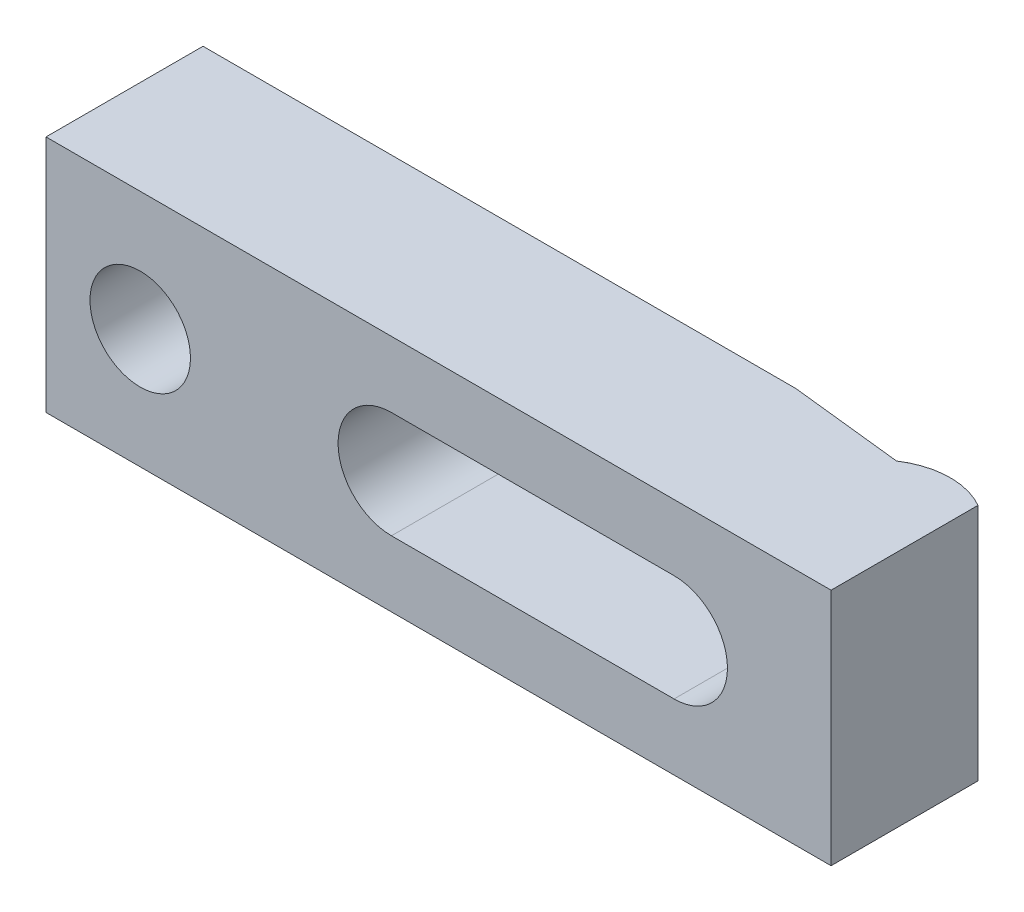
ISO-10303-21;
HEADER;
FILE_DESCRIPTION(('STEP AP214'),'2;1');
FILE_NAME('part.step','',(''),(''),'','','');
FILE_SCHEMA(('AUTOMOTIVE_DESIGN { 1 0 10303 214 1 1 1 1 }'));
ENDSEC;
DATA;
#1=APPLICATION_CONTEXT('core data for automotive mechanical design processes');
#2=APPLICATION_PROTOCOL_DEFINITION('international standard','automotive_design',2000,#1);
#3=PRODUCT_CONTEXT('',#1,'mechanical');
#4=PRODUCT('Part','Part','',(#3));
#5=PRODUCT_RELATED_PRODUCT_CATEGORY('part','',(#4));
#6=PRODUCT_DEFINITION_FORMATION('','',#4);
#7=PRODUCT_DEFINITION_CONTEXT('part definition',#1,'design');
#8=PRODUCT_DEFINITION('design','',#6,#7);
#9=PRODUCT_DEFINITION_SHAPE('','',#8);
#10=(LENGTH_UNIT() NAMED_UNIT(*) SI_UNIT(.MILLI.,.METRE.));
#11=(NAMED_UNIT(*) PLANE_ANGLE_UNIT() SI_UNIT($,.RADIAN.));
#12=(NAMED_UNIT(*) SI_UNIT($,.STERADIAN.) SOLID_ANGLE_UNIT());
#13=UNCERTAINTY_MEASURE_WITH_UNIT(LENGTH_MEASURE(1.E-05),#10,'distance_accuracy_value','');
#14=(GEOMETRIC_REPRESENTATION_CONTEXT(3) GLOBAL_UNCERTAINTY_ASSIGNED_CONTEXT((#13)) GLOBAL_UNIT_ASSIGNED_CONTEXT((#10,
#11,#12)) REPRESENTATION_CONTEXT('',''));
#15=CARTESIAN_POINT('',(0.,0.,0.));
#16=DIRECTION('',(0.,0.,1.));
#17=DIRECTION('',(1.,0.,0.));
#18=AXIS2_PLACEMENT_3D('',#15,#16,#17);
#19=CARTESIAN_POINT('',(-100.,19.,0.));
#20=DIRECTION('',(0.,0.,-1.));
#21=DIRECTION('',(-1.,0.,0.));
#22=AXIS2_PLACEMENT_3D('',#19,#20,#21);
#23=PLANE('',#22);
#24=DIRECTION('',(1.,0.,0.));
#25=VECTOR('',#24,1.);
#26=CARTESIAN_POINT('',(-40.,8.5,0.));
#27=LINE('',#26,#25);
#28=CARTESIAN_POINT('',(-100.,8.5,0.));
#29=VERTEX_POINT('',#28);
#30=CARTESIAN_POINT('',(-5.6,8.5,0.));
#31=VERTEX_POINT('',#30);
#32=EDGE_CURVE('E151',#29,#31,#27,.T.);
#33=ORIENTED_EDGE('',*,*,#32,.F.);
#34=DIRECTION('',(0.,-1.,0.));
#35=VECTOR('',#34,1.);
#36=CARTESIAN_POINT('',(-100.,19.,0.));
#37=LINE('',#36,#35);
#38=CARTESIAN_POINT('',(-100.,19.,0.));
#39=VERTEX_POINT('',#38);
#40=EDGE_CURVE('E203',#39,#29,#37,.T.);
#41=ORIENTED_EDGE('',*,*,#40,.F.);
#42=DIRECTION('',(1.,0.,0.));
#43=VECTOR('',#42,1.);
#44=CARTESIAN_POINT('',(-100.,19.,0.));
#45=LINE('',#44,#43);
#46=CARTESIAN_POINT('',(-5.6,19.,0.));
#47=VERTEX_POINT('',#46);
#48=EDGE_CURVE('E194',#39,#47,#45,.T.);
#49=ORIENTED_EDGE('',*,*,#48,.T.);
#50=DIRECTION('',(0.,-1.,0.));
#51=VECTOR('',#50,1.);
#52=CARTESIAN_POINT('',(-5.6,19.,0.));
#53=LINE('',#52,#51);
#54=EDGE_CURVE('E207',#47,#31,#53,.T.);
#55=ORIENTED_EDGE('',*,*,#54,.T.);
#56=EDGE_LOOP('',(#33,#41,#49,#55));
#57=FACE_BOUND('',#56,.T.);
#58=ADVANCED_FACE('F14',(#57),#23,.T.);
#59=CARTESIAN_POINT('',(-100.,19.,25.));
#60=DIRECTION('',(-1.,0.,0.));
#61=DIRECTION('',(0.,0.,1.));
#62=AXIS2_PLACEMENT_3D('',#59,#60,#61);
#63=PLANE('',#62);
#64=ORIENTED_EDGE('',*,*,#40,.T.);
#65=DIRECTION('',(0.,0.,1.));
#66=VECTOR('',#65,1.);
#67=CARTESIAN_POINT('',(-100.,8.5,25.));
#68=LINE('',#67,#66);
#69=CARTESIAN_POINT('',(-100.,8.5,5.));
#70=VERTEX_POINT('',#69);
#71=EDGE_CURVE('E145',#29,#70,#68,.T.);
#72=ORIENTED_EDGE('',*,*,#71,.T.);
#73=DIRECTION('',(0.,-1.,0.));
#74=VECTOR('',#73,1.);
#75=CARTESIAN_POINT('',(-100.,19.,5.));
#76=LINE('',#75,#74);
#77=CARTESIAN_POINT('',(-100.,-8.5,5.));
#78=VERTEX_POINT('',#77);
#79=EDGE_CURVE('E140',#70,#78,#76,.T.);
#80=ORIENTED_EDGE('',*,*,#79,.T.);
#81=DIRECTION('',(0.,0.,1.));
#82=VECTOR('',#81,1.);
#83=CARTESIAN_POINT('',(-100.,-8.5,25.));
#84=LINE('',#83,#82);
#85=CARTESIAN_POINT('',(-100.,-8.5,0.));
#86=VERTEX_POINT('',#85);
#87=EDGE_CURVE('E143',#86,#78,#84,.T.);
#88=ORIENTED_EDGE('',*,*,#87,.F.);
#89=CARTESIAN_POINT('',(-100.,-19.,0.));
#90=VERTEX_POINT('',#89);
#91=EDGE_CURVE('E202',#86,#90,#37,.T.);
#92=ORIENTED_EDGE('',*,*,#91,.T.);
#93=DIRECTION('',(0.,0.,-1.));
#94=VECTOR('',#93,1.);
#95=CARTESIAN_POINT('',(-100.,-19.,25.));
#96=LINE('',#95,#94);
#97=CARTESIAN_POINT('',(-100.,-19.,25.));
#98=VERTEX_POINT('',#97);
#99=EDGE_CURVE('E179',#98,#90,#96,.T.);
#100=ORIENTED_EDGE('',*,*,#99,.F.);
#101=DIRECTION('',(0.,-1.,0.));
#102=VECTOR('',#101,1.);
#103=CARTESIAN_POINT('',(-100.,19.,25.));
#104=LINE('',#103,#102);
#105=CARTESIAN_POINT('',(-100.,19.,25.));
#106=VERTEX_POINT('',#105);
#107=EDGE_CURVE('E187',#106,#98,#104,.T.);
#108=ORIENTED_EDGE('',*,*,#107,.F.);
#109=DIRECTION('',(0.,0.,-1.));
#110=VECTOR('',#109,1.);
#111=CARTESIAN_POINT('',(-100.,19.,25.));
#112=LINE('',#111,#110);
#113=EDGE_CURVE('E197',#106,#39,#112,.T.);
#114=ORIENTED_EDGE('',*,*,#113,.T.);
#115=EDGE_LOOP('',(#64,#72,#80,#88,#92,#100,#108,#114));
#116=FACE_BOUND('',#115,.T.);
#117=ADVANCED_FACE('F235',(#116),#63,.T.);
#118=CARTESIAN_POINT('',(-85.,0.,25.));
#119=DIRECTION('',(0.,0.,-1.));
#120=DIRECTION('',(-1.,0.,0.));
#121=AXIS2_PLACEMENT_3D('',#118,#119,#120);
#122=CYLINDRICAL_SURFACE('',#121,8.);
#123=CARTESIAN_POINT('',(-85.,0.,25.));
#124=DIRECTION('',(0.,0.,1.));
#125=DIRECTION('',(1.,0.,0.));
#126=AXIS2_PLACEMENT_3D('',#123,#124,#125);
#127=CIRCLE('',#126,8.);
#128=CARTESIAN_POINT('',(-77.,0.,25.));
#129=VERTEX_POINT('',#128);
#130=EDGE_CURVE('E148',#129,#129,#127,.T.);
#131=ORIENTED_EDGE('',*,*,#130,.T.);
#132=EDGE_LOOP('',(#131));
#133=FACE_BOUND('',#132,.T.);
#134=CARTESIAN_POINT('',(-85.,0.,5.));
#135=DIRECTION('',(0.,0.,-1.));
#136=DIRECTION('',(-1.,0.,0.));
#137=AXIS2_PLACEMENT_3D('',#134,#135,#136);
#138=CIRCLE('',#137,8.);
#139=CARTESIAN_POINT('',(-93.,0.,5.));
#140=VERTEX_POINT('',#139);
#141=EDGE_CURVE('E138',#140,#140,#138,.T.);
#142=ORIENTED_EDGE('',*,*,#141,.T.);
#143=EDGE_LOOP('',(#142));
#144=FACE_BOUND('',#143,.T.);
#145=ADVANCED_FACE('F218',(#133,#144),#122,.F.);
#146=CARTESIAN_POINT('',(25.,19.,25.));
#147=DIRECTION('',(0.,0.,1.));
#148=DIRECTION('',(1.,0.,0.));
#149=AXIS2_PLACEMENT_3D('',#146,#147,#148);
#150=PLANE('',#149);
#151=CARTESIAN_POINT('',(-45.,0.,25.));
#152=DIRECTION('',(0.,0.,1.));
#153=DIRECTION('',(-1.,0.,0.));
#154=AXIS2_PLACEMENT_3D('',#151,#152,#153);
#155=CIRCLE('',#154,8.5);
#156=CARTESIAN_POINT('',(-45.,8.5,25.));
#157=VERTEX_POINT('',#156);
#158=CARTESIAN_POINT('',(-45.,-8.5,25.));
#159=VERTEX_POINT('',#158);
#160=EDGE_CURVE('E115',#157,#159,#155,.T.);
#161=ORIENTED_EDGE('',*,*,#160,.F.);
#162=DIRECTION('',(1.,0.,0.));
#163=VECTOR('',#162,1.);
#164=CARTESIAN_POINT('',(-40.,8.5,25.));
#165=LINE('',#164,#163);
#166=CARTESIAN_POINT('',(0.,8.5,25.));
#167=VERTEX_POINT('',#166);
#168=EDGE_CURVE('E119',#157,#167,#165,.T.);
#169=ORIENTED_EDGE('',*,*,#168,.T.);
#170=CARTESIAN_POINT('',(0.,0.,25.));
#171=DIRECTION('',(0.,0.,1.));
#172=DIRECTION('',(1.,0.,0.));
#173=AXIS2_PLACEMENT_3D('',#170,#171,#172);
#174=CIRCLE('',#173,8.5);
#175=CARTESIAN_POINT('',(0.,-8.5,25.));
#176=VERTEX_POINT('',#175);
#177=EDGE_CURVE('E117',#176,#167,#174,.T.);
#178=ORIENTED_EDGE('',*,*,#177,.F.);
#179=DIRECTION('',(-1.,0.,0.));
#180=VECTOR('',#179,1.);
#181=CARTESIAN_POINT('',(0.,-8.5,25.));
#182=LINE('',#181,#180);
#183=EDGE_CURVE('E111',#176,#159,#182,.T.);
#184=ORIENTED_EDGE('',*,*,#183,.T.);
#185=EDGE_LOOP('',(#161,#169,#178,#184));
#186=FACE_BOUND('',#185,.T.);
#187=DIRECTION('',(0.,-1.,0.));
#188=VECTOR('',#187,1.);
#189=CARTESIAN_POINT('',(25.,19.,25.));
#190=LINE('',#189,#188);
#191=CARTESIAN_POINT('',(25.,19.,25.));
#192=VERTEX_POINT('',#191);
#193=CARTESIAN_POINT('',(25.,-19.,25.));
#194=VERTEX_POINT('',#193);
#195=EDGE_CURVE('E37',#192,#194,#190,.T.);
#196=ORIENTED_EDGE('',*,*,#195,.F.);
#197=DIRECTION('',(-1.,0.,0.));
#198=VECTOR('',#197,1.);
#199=CARTESIAN_POINT('',(25.,19.,25.));
#200=LINE('',#199,#198);
#201=EDGE_CURVE('E169',#192,#106,#200,.T.);
#202=ORIENTED_EDGE('',*,*,#201,.T.);
#203=ORIENTED_EDGE('',*,*,#107,.T.);
#204=DIRECTION('',(-1.,0.,0.));
#205=VECTOR('',#204,1.);
#206=CARTESIAN_POINT('',(25.,-19.,25.));
#207=LINE('',#206,#205);
#208=EDGE_CURVE('E165',#194,#98,#207,.T.);
#209=ORIENTED_EDGE('',*,*,#208,.F.);
#210=EDGE_LOOP('',(#196,#202,#203,#209));
#211=FACE_BOUND('',#210,.T.);
#212=ORIENTED_EDGE('',*,*,#130,.F.);
#213=EDGE_LOOP('',(#212));
#214=FACE_BOUND('',#213,.T.);
#215=ADVANCED_FACE('F113',(#186,#211,#214),#150,.T.);
#216=ORIENTED_EDGE('',*,*,#91,.F.);
#217=DIRECTION('',(-1.,0.,0.));
#218=VECTOR('',#217,1.);
#219=CARTESIAN_POINT('',(0.,-8.5,0.));
#220=LINE('',#219,#218);
#221=CARTESIAN_POINT('',(-5.6,-8.5,0.));
#222=VERTEX_POINT('',#221);
#223=EDGE_CURVE('E152',#222,#86,#220,.T.);
#224=ORIENTED_EDGE('',*,*,#223,.F.);
#225=CARTESIAN_POINT('',(-5.6,-19.,0.));
#226=VERTEX_POINT('',#225);
#227=EDGE_CURVE('E206',#222,#226,#53,.T.);
#228=ORIENTED_EDGE('',*,*,#227,.T.);
#229=DIRECTION('',(1.,0.,0.));
#230=VECTOR('',#229,1.);
#231=CARTESIAN_POINT('',(-100.,-19.,0.));
#232=LINE('',#231,#230);
#233=EDGE_CURVE('E176',#90,#226,#232,.T.);
#234=ORIENTED_EDGE('',*,*,#233,.F.);
#235=EDGE_LOOP('',(#216,#224,#228,#234));
#236=FACE_BOUND('',#235,.T.);
#237=ADVANCED_FACE('F238',(#236),#23,.T.);
#238=CARTESIAN_POINT('',(25.,19.,25.));
#239=DIRECTION('',(-1.,0.,0.));
#240=DIRECTION('',(0.,0.,1.));
#241=AXIS2_PLACEMENT_3D('',#238,#239,#240);
#242=PLANE('',#241);
#243=DIRECTION('',(0.,-1.,0.));
#244=VECTOR('',#243,1.);
#245=CARTESIAN_POINT('',(25.,19.,1.60769515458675));
#246=LINE('',#245,#244);
#247=CARTESIAN_POINT('',(25.,19.,1.60769515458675));
#248=VERTEX_POINT('',#247);
#249=CARTESIAN_POINT('',(25.,-19.,1.60769515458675));
#250=VERTEX_POINT('',#249);
#251=EDGE_CURVE('E212',#248,#250,#246,.T.);
#252=ORIENTED_EDGE('',*,*,#251,.F.);
#253=DIRECTION('',(0.,0.,-1.));
#254=VECTOR('',#253,1.);
#255=CARTESIAN_POINT('',(25.,19.,25.));
#256=LINE('',#255,#254);
#257=EDGE_CURVE('E184',#192,#248,#256,.T.);
#258=ORIENTED_EDGE('',*,*,#257,.F.);
#259=ORIENTED_EDGE('',*,*,#195,.T.);
#260=DIRECTION('',(0.,0.,-1.));
#261=VECTOR('',#260,1.);
#262=CARTESIAN_POINT('',(25.,-19.,25.));
#263=LINE('',#262,#261);
#264=EDGE_CURVE('E166',#194,#250,#263,.T.);
#265=ORIENTED_EDGE('',*,*,#264,.T.);
#266=EDGE_LOOP('',(#252,#258,#259,#265));
#267=FACE_BOUND('',#266,.T.);
#268=ADVANCED_FACE('F16',(#267),#242,.F.);
#269=CARTESIAN_POINT('',(19.,19.,12.));
#270=DIRECTION('',(0.,-1.,0.));
#271=DIRECTION('',(0.,0.,-1.));
#272=AXIS2_PLACEMENT_3D('',#269,#270,#271);
#273=CYLINDRICAL_SURFACE('',#272,12.);
#274=DIRECTION('',(0.,-1.,0.));
#275=VECTOR('',#274,1.);
#276=CARTESIAN_POINT('',(12.4,19.,1.97802414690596));
#277=LINE('',#276,#275);
#278=CARTESIAN_POINT('',(12.4,19.,1.97802414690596));
#279=VERTEX_POINT('',#278);
#280=CARTESIAN_POINT('',(12.4,-19.,1.97802414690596));
#281=VERTEX_POINT('',#280);
#282=EDGE_CURVE('E210',#279,#281,#277,.T.);
#283=ORIENTED_EDGE('',*,*,#282,.F.);
#284=CARTESIAN_POINT('',(19.,19.,12.));
#285=DIRECTION('',(0.,1.,0.));
#286=DIRECTION('',(0.,0.,1.));
#287=AXIS2_PLACEMENT_3D('',#284,#285,#286);
#288=CIRCLE('',#287,12.);
#289=EDGE_CURVE('E188',#248,#279,#288,.T.);
#290=ORIENTED_EDGE('',*,*,#289,.F.);
#291=ORIENTED_EDGE('',*,*,#251,.T.);
#292=CARTESIAN_POINT('',(19.,-19.,12.));
#293=DIRECTION('',(0.,1.,0.));
#294=DIRECTION('',(0.,0.,1.));
#295=AXIS2_PLACEMENT_3D('',#292,#293,#294);
#296=CIRCLE('',#295,12.);
#297=EDGE_CURVE('E170',#250,#281,#296,.T.);
#298=ORIENTED_EDGE('',*,*,#297,.T.);
#299=EDGE_LOOP('',(#283,#290,#291,#298));
#300=FACE_BOUND('',#299,.T.);
#301=ADVANCED_FACE('F253',(#300),#273,.T.);
#302=CARTESIAN_POINT('',(12.4,19.,1.97802414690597));
#303=DIRECTION('',(-0.109232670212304,0.,0.99401620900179));
#304=DIRECTION('',(0.99401620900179,0.,0.109232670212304));
#305=AXIS2_PLACEMENT_3D('',#302,#303,#304);
#306=PLANE('',#305);
#307=CARTESIAN_POINT('',(0.,0.,0.615385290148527));
#308=DIRECTION('',(-0.109232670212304,0.,0.99401620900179));
#309=DIRECTION('',(-0.99401620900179,0.,-0.109232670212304));
#310=AXIS2_PLACEMENT_3D('',#307,#308,#309);
#311=ELLIPSE('',#310,8.55116840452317,8.5);
#312=CARTESIAN_POINT('',(0.,8.5,0.615385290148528));
#313=VERTEX_POINT('',#312);
#314=CARTESIAN_POINT('',(0.,-8.5,0.615385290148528));
#315=VERTEX_POINT('',#314);
#316=EDGE_CURVE('E22',#313,#315,#311,.F.);
#317=ORIENTED_EDGE('',*,*,#316,.F.);
#318=DIRECTION('',(-0.99401620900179,0.,-0.109232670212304));
#319=VECTOR('',#318,1.);
#320=CARTESIAN_POINT('',(12.4,8.5,1.97802414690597));
#321=LINE('',#320,#319);
#322=EDGE_CURVE('E162',#313,#31,#321,.T.);
#323=ORIENTED_EDGE('',*,*,#322,.T.);
#324=ORIENTED_EDGE('',*,*,#54,.F.);
#325=DIRECTION('',(-0.99401620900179,0.,-0.109232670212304));
#326=VECTOR('',#325,1.);
#327=CARTESIAN_POINT('',(12.4,19.,1.97802414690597));
#328=LINE('',#327,#326);
#329=EDGE_CURVE('E191',#279,#47,#328,.T.);
#330=ORIENTED_EDGE('',*,*,#329,.F.);
#331=ORIENTED_EDGE('',*,*,#282,.T.);
#332=DIRECTION('',(-0.99401620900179,0.,-0.109232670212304));
#333=VECTOR('',#332,1.);
#334=CARTESIAN_POINT('',(12.4,-19.,1.97802414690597));
#335=LINE('',#334,#333);
#336=EDGE_CURVE('E173',#281,#226,#335,.T.);
#337=ORIENTED_EDGE('',*,*,#336,.T.);
#338=ORIENTED_EDGE('',*,*,#227,.F.);
#339=DIRECTION('',(0.99401620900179,0.,0.109232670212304));
#340=VECTOR('',#339,1.);
#341=CARTESIAN_POINT('',(12.4,-8.5,1.97802414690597));
#342=LINE('',#341,#340);
#343=EDGE_CURVE('E29',#222,#315,#342,.T.);
#344=ORIENTED_EDGE('',*,*,#343,.T.);
#345=EDGE_LOOP('',(#317,#323,#324,#330,#331,#337,#338,#344));
#346=FACE_BOUND('',#345,.T.);
#347=ADVANCED_FACE('F281',(#346),#306,.F.);
#348=CARTESIAN_POINT('',(19.,19.,12.));
#349=DIRECTION('',(0.,1.,0.));
#350=DIRECTION('',(0.,0.,1.));
#351=AXIS2_PLACEMENT_3D('',#348,#349,#350);
#352=PLANE('',#351);
#353=ORIENTED_EDGE('',*,*,#201,.F.);
#354=ORIENTED_EDGE('',*,*,#257,.T.);
#355=ORIENTED_EDGE('',*,*,#289,.T.);
#356=ORIENTED_EDGE('',*,*,#329,.T.);
#357=ORIENTED_EDGE('',*,*,#48,.F.);
#358=ORIENTED_EDGE('',*,*,#113,.F.);
#359=EDGE_LOOP('',(#353,#354,#355,#356,#357,#358));
#360=FACE_BOUND('',#359,.T.);
#361=ADVANCED_FACE('F270',(#360),#352,.T.);
#362=CARTESIAN_POINT('',(19.,-19.,12.));
#363=DIRECTION('',(0.,1.,0.));
#364=DIRECTION('',(0.,0.,1.));
#365=AXIS2_PLACEMENT_3D('',#362,#363,#364);
#366=PLANE('',#365);
#367=ORIENTED_EDGE('',*,*,#208,.T.);
#368=ORIENTED_EDGE('',*,*,#99,.T.);
#369=ORIENTED_EDGE('',*,*,#233,.T.);
#370=ORIENTED_EDGE('',*,*,#336,.F.);
#371=ORIENTED_EDGE('',*,*,#297,.F.);
#372=ORIENTED_EDGE('',*,*,#264,.F.);
#373=EDGE_LOOP('',(#367,#368,#369,#370,#371,#372));
#374=FACE_BOUND('',#373,.T.);
#375=ADVANCED_FACE('F262',(#374),#366,.F.);
#376=CARTESIAN_POINT('',(0.,0.,25.));
#377=DIRECTION('',(0.,0.,-1.));
#378=DIRECTION('',(-1.,0.,0.));
#379=AXIS2_PLACEMENT_3D('',#376,#377,#378);
#380=CYLINDRICAL_SURFACE('',#379,8.5);
#381=ORIENTED_EDGE('',*,*,#316,.T.);
#382=DIRECTION('',(0.,0.,-1.));
#383=VECTOR('',#382,1.);
#384=CARTESIAN_POINT('',(0.,-8.5,25.));
#385=LINE('',#384,#383);
#386=EDGE_CURVE('E118',#176,#315,#385,.T.);
#387=ORIENTED_EDGE('',*,*,#386,.F.);
#388=ORIENTED_EDGE('',*,*,#177,.T.);
#389=DIRECTION('',(0.,0.,-1.));
#390=VECTOR('',#389,1.);
#391=CARTESIAN_POINT('',(0.,8.5,25.));
#392=LINE('',#391,#390);
#393=EDGE_CURVE('E158',#167,#313,#392,.T.);
#394=ORIENTED_EDGE('',*,*,#393,.T.);
#395=EDGE_LOOP('',(#381,#387,#388,#394));
#396=FACE_BOUND('',#395,.T.);
#397=ADVANCED_FACE('F279',(#396),#380,.F.);
#398=CARTESIAN_POINT('',(-40.,8.5,25.));
#399=DIRECTION('',(0.,1.,0.));
#400=DIRECTION('',(0.,0.,1.));
#401=AXIS2_PLACEMENT_3D('',#398,#399,#400);
#402=PLANE('',#401);
#403=ORIENTED_EDGE('',*,*,#393,.F.);
#404=ORIENTED_EDGE('',*,*,#168,.F.);
#405=DIRECTION('',(0.,0.,1.));
#406=VECTOR('',#405,1.);
#407=CARTESIAN_POINT('',(-45.,8.5,0.));
#408=LINE('',#407,#406);
#409=CARTESIAN_POINT('',(-45.,8.5,5.));
#410=VERTEX_POINT('',#409);
#411=EDGE_CURVE('E128',#410,#157,#408,.T.);
#412=ORIENTED_EDGE('',*,*,#411,.F.);
#413=DIRECTION('',(-1.,0.,0.));
#414=VECTOR('',#413,1.);
#415=CARTESIAN_POINT('',(-15.,8.5,5.));
#416=LINE('',#415,#414);
#417=EDGE_CURVE('E136',#410,#70,#416,.T.);
#418=ORIENTED_EDGE('',*,*,#417,.T.);
#419=ORIENTED_EDGE('',*,*,#71,.F.);
#420=ORIENTED_EDGE('',*,*,#32,.T.);
#421=ORIENTED_EDGE('',*,*,#322,.F.);
#422=EDGE_LOOP('',(#403,#404,#412,#418,#419,#420,#421));
#423=FACE_BOUND('',#422,.T.);
#424=ADVANCED_FACE('F231',(#423),#402,.F.);
#425=CARTESIAN_POINT('',(0.,-8.5,25.));
#426=DIRECTION('',(0.,-1.,0.));
#427=DIRECTION('',(1.,0.,0.));
#428=AXIS2_PLACEMENT_3D('',#425,#426,#427);
#429=PLANE('',#428);
#430=ORIENTED_EDGE('',*,*,#223,.T.);
#431=ORIENTED_EDGE('',*,*,#87,.T.);
#432=DIRECTION('',(-1.,0.,0.));
#433=VECTOR('',#432,1.);
#434=CARTESIAN_POINT('',(-15.,-8.5,5.));
#435=LINE('',#434,#433);
#436=CARTESIAN_POINT('',(-45.,-8.5,5.));
#437=VERTEX_POINT('',#436);
#438=EDGE_CURVE('E125',#437,#78,#435,.T.);
#439=ORIENTED_EDGE('',*,*,#438,.F.);
#440=DIRECTION('',(0.,0.,1.));
#441=VECTOR('',#440,1.);
#442=CARTESIAN_POINT('',(-45.,-8.5,0.));
#443=LINE('',#442,#441);
#444=EDGE_CURVE('E122',#437,#159,#443,.T.);
#445=ORIENTED_EDGE('',*,*,#444,.T.);
#446=ORIENTED_EDGE('',*,*,#183,.F.);
#447=ORIENTED_EDGE('',*,*,#386,.T.);
#448=ORIENTED_EDGE('',*,*,#343,.F.);
#449=EDGE_LOOP('',(#430,#431,#439,#445,#446,#447,#448));
#450=FACE_BOUND('',#449,.T.);
#451=ADVANCED_FACE('F123',(#450),#429,.F.);
#452=CARTESIAN_POINT('',(-15.,8.5,5.));
#453=DIRECTION('',(0.,0.,-1.));
#454=DIRECTION('',(-1.,0.,0.));
#455=AXIS2_PLACEMENT_3D('',#452,#453,#454);
#456=PLANE('',#455);
#457=CARTESIAN_POINT('',(-45.,0.,5.));
#458=DIRECTION('',(0.,0.,-1.));
#459=DIRECTION('',(1.,0.,0.));
#460=AXIS2_PLACEMENT_3D('',#457,#458,#459);
#461=CIRCLE('',#460,8.5);
#462=EDGE_CURVE('E9',#437,#410,#461,.T.);
#463=ORIENTED_EDGE('',*,*,#462,.F.);
#464=ORIENTED_EDGE('',*,*,#438,.T.);
#465=ORIENTED_EDGE('',*,*,#79,.F.);
#466=ORIENTED_EDGE('',*,*,#417,.F.);
#467=EDGE_LOOP('',(#463,#464,#465,#466));
#468=FACE_BOUND('',#467,.T.);
#469=ORIENTED_EDGE('',*,*,#141,.F.);
#470=EDGE_LOOP('',(#469));
#471=FACE_BOUND('',#470,.T.);
#472=ADVANCED_FACE('F220',(#468,#471),#456,.T.);
#473=CARTESIAN_POINT('',(-45.,0.,0.));
#474=DIRECTION('',(0.,0.,1.));
#475=DIRECTION('',(-1.,0.,0.));
#476=AXIS2_PLACEMENT_3D('',#473,#474,#475);
#477=CYLINDRICAL_SURFACE('',#476,8.5);
#478=ORIENTED_EDGE('',*,*,#462,.T.);
#479=ORIENTED_EDGE('',*,*,#411,.T.);
#480=ORIENTED_EDGE('',*,*,#160,.T.);
#481=ORIENTED_EDGE('',*,*,#444,.F.);
#482=EDGE_LOOP('',(#478,#479,#480,#481));
#483=FACE_BOUND('',#482,.T.);
#484=ADVANCED_FACE('F131',(#483),#477,.F.);
#485=CLOSED_SHELL('',(#58,#117,#145,#215,#237,#268,#301,#347,#361,#375,#397,#424,#451,#472,#484));
#486=MANIFOLD_SOLID_BREP('B1',#485);
#487=ADVANCED_BREP_SHAPE_REPRESENTATION('',(#18,#486),#14);
#488=SHAPE_DEFINITION_REPRESENTATION(#9,#487);
ENDSEC;
END-ISO-10303-21;
